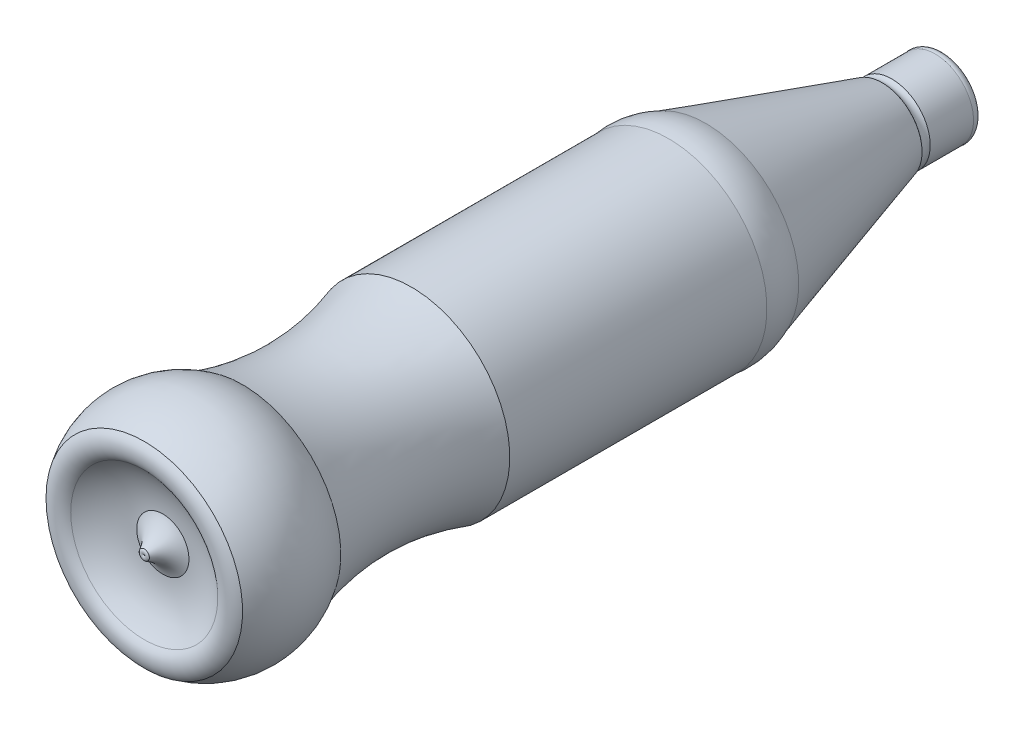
from build123d import *


with BuildPart() as part:
    # Sketch 1 → Revolve 1 (revolve)
    with BuildSketch(Plane(origin=(0, 0, 0), x_dir=(1, 0, 0), z_dir=(0, 1, 0)), mode=Mode.PRIVATE) as revolve_1_sk:
        with BuildLine():
            Line((0, 113.622047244), (0, -146.377952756))
            ThreePointArc((0, -146.377952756), (0.830372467, -146.721904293), (1.660744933, -146.377952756))
            ThreePointArc((1.660744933, -146.377952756), (4.498122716, -142.699884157), (8.49705608, -140.336108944))
            ThreePointArc((8.49705608, -140.336108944), (16.7652277, -141.964768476), (23.944294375, -146.377952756))
            ThreePointArc((23.944294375, -146.377952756), (27.972147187, -148.046344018), (32, -146.377952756))
            ThreePointArc((32, -146.377952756), (36.929227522, -130.377952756), (32, -114.377952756))
            ThreePointArc((32, -114.377952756), (27.726157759, -86.877952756), (32, -59.377952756))
            Line((32, -59.377952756), (32, 24.33984277))
            ThreePointArc((32, 24.33984277), (32.021258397, 30.525617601), (30.250816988, 36.452657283))
            Line((30.250816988, 36.452657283), (13.044231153, 93.8079434))
            ThreePointArc((13.044231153, 93.8079434), (12.110087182, 95.293507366), (12.5, 97.004499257))
            Line((12.5, 97.004499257), (12.5, 111.10990644))
            ThreePointArc((12.5, 111.10990644), (12.320839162, 112.655695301), (11.101115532, 113.622047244))
            Line((11.101115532, 113.622047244), (0, 113.622047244))
        make_face()
    revolve(revolve_1_sk.sketch.rotate(Axis((0, 0, -113.622047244), (0, 0, 1)), 180), axis=Axis((0, 0, -113.622047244), (0, 0, 1)))


solid = part.part
